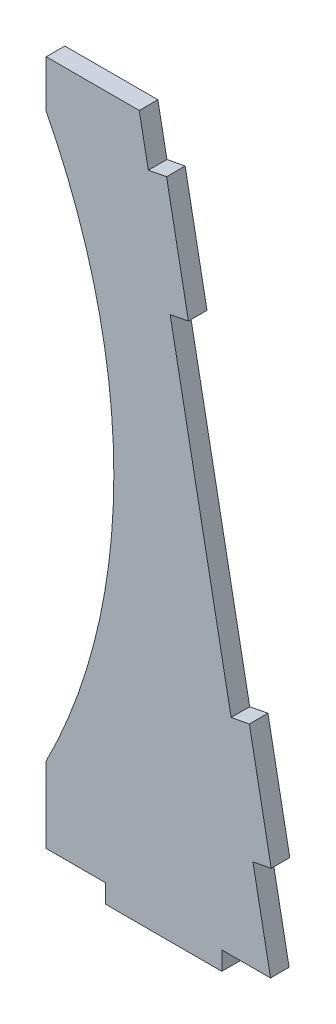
ISO-10303-21;
HEADER;
FILE_DESCRIPTION(('STEP AP214'),'2;1');
FILE_NAME('part.step','',(''),(''),'','','');
FILE_SCHEMA(('AUTOMOTIVE_DESIGN { 1 0 10303 214 1 1 1 1 }'));
ENDSEC;
DATA;
#1=APPLICATION_CONTEXT('core data for automotive mechanical design processes');
#2=APPLICATION_PROTOCOL_DEFINITION('international standard','automotive_design',2000,#1);
#3=PRODUCT_CONTEXT('',#1,'mechanical');
#4=PRODUCT('Part','Part','',(#3));
#5=PRODUCT_RELATED_PRODUCT_CATEGORY('part','',(#4));
#6=PRODUCT_DEFINITION_FORMATION('','',#4);
#7=PRODUCT_DEFINITION_CONTEXT('part definition',#1,'design');
#8=PRODUCT_DEFINITION('design','',#6,#7);
#9=PRODUCT_DEFINITION_SHAPE('','',#8);
#10=(LENGTH_UNIT() NAMED_UNIT(*) SI_UNIT(.MILLI.,.METRE.));
#11=(NAMED_UNIT(*) PLANE_ANGLE_UNIT() SI_UNIT($,.RADIAN.));
#12=(NAMED_UNIT(*) SI_UNIT($,.STERADIAN.) SOLID_ANGLE_UNIT());
#13=UNCERTAINTY_MEASURE_WITH_UNIT(LENGTH_MEASURE(1.E-05),#10,'distance_accuracy_value','');
#14=(GEOMETRIC_REPRESENTATION_CONTEXT(3) GLOBAL_UNCERTAINTY_ASSIGNED_CONTEXT((#13)) GLOBAL_UNIT_ASSIGNED_CONTEXT((#10,
#11,#12)) REPRESENTATION_CONTEXT('',''));
#15=CARTESIAN_POINT('',(0.,0.,0.));
#16=DIRECTION('',(0.,0.,1.));
#17=DIRECTION('',(1.,0.,0.));
#18=AXIS2_PLACEMENT_3D('',#15,#16,#17);
#19=CARTESIAN_POINT('',(28.5736769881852,1.143,1.524));
#20=DIRECTION('',(0.,1.,0.));
#21=DIRECTION('',(0.,0.,1.));
#22=AXIS2_PLACEMENT_3D('',#19,#20,#21);
#23=PLANE('',#22);
#24=DIRECTION('',(1.,0.,0.));
#25=VECTOR('',#24,1.);
#26=CARTESIAN_POINT('',(28.5736769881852,1.143,0.));
#27=LINE('',#26,#25);
#28=CARTESIAN_POINT('',(28.5736769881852,1.143,0.));
#29=VERTEX_POINT('',#28);
#30=CARTESIAN_POINT('',(33.443650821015,1.143,0.));
#31=VERTEX_POINT('',#30);
#32=EDGE_CURVE('E192',#29,#31,#27,.T.);
#33=ORIENTED_EDGE('',*,*,#32,.T.);
#34=DIRECTION('',(0.,0.,-1.));
#35=VECTOR('',#34,1.);
#36=CARTESIAN_POINT('',(33.443650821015,1.143,1.524));
#37=LINE('',#36,#35);
#38=CARTESIAN_POINT('',(33.443650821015,1.143,1.524));
#39=VERTEX_POINT('',#38);
#40=EDGE_CURVE('E11',#39,#31,#37,.T.);
#41=ORIENTED_EDGE('',*,*,#40,.F.);
#42=DIRECTION('',(1.,0.,0.));
#43=VECTOR('',#42,1.);
#44=CARTESIAN_POINT('',(28.5736769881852,1.143,1.524));
#45=LINE('',#44,#43);
#46=CARTESIAN_POINT('',(28.5736769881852,1.143,1.524));
#47=VERTEX_POINT('',#46);
#48=EDGE_CURVE('E226',#47,#39,#45,.T.);
#49=ORIENTED_EDGE('',*,*,#48,.F.);
#50=DIRECTION('',(0.,0.,-1.));
#51=VECTOR('',#50,1.);
#52=CARTESIAN_POINT('',(28.5736769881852,1.143,1.524));
#53=LINE('',#52,#51);
#54=EDGE_CURVE('E188',#47,#29,#53,.T.);
#55=ORIENTED_EDGE('',*,*,#54,.T.);
#56=EDGE_LOOP('',(#33,#41,#49,#55));
#57=FACE_BOUND('',#56,.T.);
#58=ADVANCED_FACE('F36',(#57),#23,.F.);
#59=CARTESIAN_POINT('',(33.443650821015,1.143,1.524));
#60=DIRECTION('',(1.,0.,0.));
#61=DIRECTION('',(0.,0.,-1.));
#62=AXIS2_PLACEMENT_3D('',#59,#60,#61);
#63=PLANE('',#62);
#64=DIRECTION('',(0.,-1.,0.));
#65=VECTOR('',#64,1.);
#66=CARTESIAN_POINT('',(33.443650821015,1.143,0.));
#67=LINE('',#66,#65);
#68=CARTESIAN_POINT('',(33.443650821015,-0.381,0.));
#69=VERTEX_POINT('',#68);
#70=EDGE_CURVE('E195',#31,#69,#67,.T.);
#71=ORIENTED_EDGE('',*,*,#70,.T.);
#72=DIRECTION('',(0.,0.,-1.));
#73=VECTOR('',#72,1.);
#74=CARTESIAN_POINT('',(33.443650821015,-0.381,1.524));
#75=LINE('',#74,#73);
#76=CARTESIAN_POINT('',(33.443650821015,-0.381,1.524));
#77=VERTEX_POINT('',#76);
#78=EDGE_CURVE('E44',#77,#69,#75,.T.);
#79=ORIENTED_EDGE('',*,*,#78,.F.);
#80=DIRECTION('',(0.,-1.,0.));
#81=VECTOR('',#80,1.);
#82=CARTESIAN_POINT('',(33.443650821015,1.143,1.524));
#83=LINE('',#82,#81);
#84=EDGE_CURVE('E125',#39,#77,#83,.T.);
#85=ORIENTED_EDGE('',*,*,#84,.F.);
#86=ORIENTED_EDGE('',*,*,#40,.T.);
#87=EDGE_LOOP('',(#71,#79,#85,#86));
#88=FACE_BOUND('',#87,.T.);
#89=ADVANCED_FACE('F334',(#88),#63,.F.);
#90=CARTESIAN_POINT('',(33.443650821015,-0.381,1.524));
#91=DIRECTION('',(0.,1.,0.));
#92=DIRECTION('',(0.,0.,1.));
#93=AXIS2_PLACEMENT_3D('',#90,#91,#92);
#94=PLANE('',#93);
#95=DIRECTION('',(1.,0.,0.));
#96=VECTOR('',#95,1.);
#97=CARTESIAN_POINT('',(33.443650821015,-0.381,0.));
#98=LINE('',#97,#96);
#99=CARTESIAN_POINT('',(42.968650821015,-0.381,0.));
#100=VERTEX_POINT('',#99);
#101=EDGE_CURVE('E197',#69,#100,#98,.T.);
#102=ORIENTED_EDGE('',*,*,#101,.T.);
#103=DIRECTION('',(0.,0.,-1.));
#104=VECTOR('',#103,1.);
#105=CARTESIAN_POINT('',(42.968650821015,-0.381,1.524));
#106=LINE('',#105,#104);
#107=CARTESIAN_POINT('',(42.968650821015,-0.381,1.524));
#108=VERTEX_POINT('',#107);
#109=EDGE_CURVE('E263',#108,#100,#106,.T.);
#110=ORIENTED_EDGE('',*,*,#109,.F.);
#111=DIRECTION('',(1.,0.,0.));
#112=VECTOR('',#111,1.);
#113=CARTESIAN_POINT('',(33.443650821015,-0.381,1.524));
#114=LINE('',#113,#112);
#115=EDGE_CURVE('E271',#77,#108,#114,.T.);
#116=ORIENTED_EDGE('',*,*,#115,.F.);
#117=ORIENTED_EDGE('',*,*,#78,.T.);
#118=EDGE_LOOP('',(#102,#110,#116,#117));
#119=FACE_BOUND('',#118,.T.);
#120=ADVANCED_FACE('F269',(#119),#94,.F.);
#121=CARTESIAN_POINT('',(42.968650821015,-0.381,1.524));
#122=DIRECTION('',(-1.,0.,0.));
#123=DIRECTION('',(0.,0.,1.));
#124=AXIS2_PLACEMENT_3D('',#121,#122,#123);
#125=PLANE('',#124);
#126=DIRECTION('',(0.,1.,0.));
#127=VECTOR('',#126,1.);
#128=CARTESIAN_POINT('',(42.968650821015,-0.381,0.));
#129=LINE('',#128,#127);
#130=CARTESIAN_POINT('',(42.968650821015,1.143,0.));
#131=VERTEX_POINT('',#130);
#132=EDGE_CURVE('E199',#100,#131,#129,.T.);
#133=ORIENTED_EDGE('',*,*,#132,.T.);
#134=DIRECTION('',(0.,0.,-1.));
#135=VECTOR('',#134,1.);
#136=CARTESIAN_POINT('',(42.968650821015,1.143,1.524));
#137=LINE('',#136,#135);
#138=CARTESIAN_POINT('',(42.968650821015,1.143,1.524));
#139=VERTEX_POINT('',#138);
#140=EDGE_CURVE('E260',#139,#131,#137,.T.);
#141=ORIENTED_EDGE('',*,*,#140,.F.);
#142=DIRECTION('',(0.,1.,0.));
#143=VECTOR('',#142,1.);
#144=CARTESIAN_POINT('',(42.968650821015,-0.381,1.524));
#145=LINE('',#144,#143);
#146=EDGE_CURVE('E289',#108,#139,#145,.T.);
#147=ORIENTED_EDGE('',*,*,#146,.F.);
#148=ORIENTED_EDGE('',*,*,#109,.T.);
#149=EDGE_LOOP('',(#133,#141,#147,#148));
#150=FACE_BOUND('',#149,.T.);
#151=ADVANCED_FACE('F280',(#150),#125,.F.);
#152=CARTESIAN_POINT('',(42.968650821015,1.143,1.524));
#153=DIRECTION('',(0.,1.,0.));
#154=DIRECTION('',(-1.,0.,0.));
#155=AXIS2_PLACEMENT_3D('',#152,#153,#154);
#156=PLANE('',#155);
#157=DIRECTION('',(1.,0.,0.));
#158=VECTOR('',#157,1.);
#159=CARTESIAN_POINT('',(42.968650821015,1.143,0.));
#160=LINE('',#159,#158);
#161=CARTESIAN_POINT('',(46.9624933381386,1.14300000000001,0.));
#162=VERTEX_POINT('',#161);
#163=EDGE_CURVE('E201',#131,#162,#160,.T.);
#164=ORIENTED_EDGE('',*,*,#163,.T.);
#165=DIRECTION('',(0.,0.,-1.));
#166=VECTOR('',#165,1.);
#167=CARTESIAN_POINT('',(46.9624933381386,1.14300000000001,1.524));
#168=LINE('',#167,#166);
#169=CARTESIAN_POINT('',(46.9624933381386,1.14300000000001,1.524));
#170=VERTEX_POINT('',#169);
#171=EDGE_CURVE('E257',#170,#162,#168,.T.);
#172=ORIENTED_EDGE('',*,*,#171,.F.);
#173=DIRECTION('',(1.,0.,0.));
#174=VECTOR('',#173,1.);
#175=CARTESIAN_POINT('',(42.968650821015,1.143,1.524));
#176=LINE('',#175,#174);
#177=EDGE_CURVE('E286',#139,#170,#176,.T.);
#178=ORIENTED_EDGE('',*,*,#177,.F.);
#179=ORIENTED_EDGE('',*,*,#140,.T.);
#180=EDGE_LOOP('',(#164,#172,#178,#179));
#181=FACE_BOUND('',#180,.T.);
#182=ADVANCED_FACE('F284',(#181),#156,.F.);
#183=CARTESIAN_POINT('',(46.9624933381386,1.14300000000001,1.524));
#184=DIRECTION('',(-0.982176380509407,-0.187961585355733,0.));
#185=DIRECTION('',(0.187961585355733,-0.982176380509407,0.));
#186=AXIS2_PLACEMENT_3D('',#183,#184,#185);
#187=PLANE('',#186);
#188=DIRECTION('',(-0.187961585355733,0.982176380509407,0.));
#189=VECTOR('',#188,1.);
#190=CARTESIAN_POINT('',(46.9624933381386,1.14300000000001,0.));
#191=LINE('',#190,#189);
#192=CARTESIAN_POINT('',(45.5219223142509,8.67057448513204,0.));
#193=VERTEX_POINT('',#192);
#194=EDGE_CURVE('E203',#162,#193,#191,.T.);
#195=ORIENTED_EDGE('',*,*,#194,.T.);
#196=DIRECTION('',(0.,0.,-1.));
#197=VECTOR('',#196,1.);
#198=CARTESIAN_POINT('',(45.5219223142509,8.67057448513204,1.524));
#199=LINE('',#198,#197);
#200=CARTESIAN_POINT('',(45.5219223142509,8.67057448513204,1.524));
#201=VERTEX_POINT('',#200);
#202=EDGE_CURVE('E254',#201,#193,#199,.T.);
#203=ORIENTED_EDGE('',*,*,#202,.F.);
#204=DIRECTION('',(-0.187961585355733,0.982176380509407,0.));
#205=VECTOR('',#204,1.);
#206=CARTESIAN_POINT('',(46.9624933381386,1.14300000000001,1.524));
#207=LINE('',#206,#205);
#208=EDGE_CURVE('E288',#170,#201,#207,.T.);
#209=ORIENTED_EDGE('',*,*,#208,.F.);
#210=ORIENTED_EDGE('',*,*,#171,.T.);
#211=EDGE_LOOP('',(#195,#203,#209,#210));
#212=FACE_BOUND('',#211,.T.);
#213=ADVANCED_FACE('F347',(#212),#187,.F.);
#214=CARTESIAN_POINT('',(45.5219223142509,8.67057448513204,1.524));
#215=DIRECTION('',(-0.187961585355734,0.982176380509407,0.));
#216=DIRECTION('',(-0.982176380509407,-0.187961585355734,0.));
#217=AXIS2_PLACEMENT_3D('',#214,#215,#216);
#218=PLANE('',#217);
#219=DIRECTION('',(0.982176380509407,0.187961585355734,0.));
#220=VECTOR('',#219,1.);
#221=CARTESIAN_POINT('',(45.5219223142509,8.67057448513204,0.));
#222=LINE('',#221,#220);
#223=CARTESIAN_POINT('',(47.0187591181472,8.95702794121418,0.));
#224=VERTEX_POINT('',#223);
#225=EDGE_CURVE('E205',#193,#224,#222,.T.);
#226=ORIENTED_EDGE('',*,*,#225,.T.);
#227=DIRECTION('',(0.,0.,-1.));
#228=VECTOR('',#227,1.);
#229=CARTESIAN_POINT('',(47.0187591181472,8.95702794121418,1.524));
#230=LINE('',#229,#228);
#231=CARTESIAN_POINT('',(47.0187591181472,8.95702794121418,1.524));
#232=VERTEX_POINT('',#231);
#233=EDGE_CURVE('E251',#232,#224,#230,.T.);
#234=ORIENTED_EDGE('',*,*,#233,.F.);
#235=DIRECTION('',(0.982176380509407,0.187961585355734,0.));
#236=VECTOR('',#235,1.);
#237=CARTESIAN_POINT('',(45.5219223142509,8.67057448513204,1.524));
#238=LINE('',#237,#236);
#239=EDGE_CURVE('E291',#201,#232,#238,.T.);
#240=ORIENTED_EDGE('',*,*,#239,.F.);
#241=ORIENTED_EDGE('',*,*,#202,.T.);
#242=EDGE_LOOP('',(#226,#234,#240,#241));
#243=FACE_BOUND('',#242,.T.);
#244=ADVANCED_FACE('F350',(#243),#218,.F.);
#245=CARTESIAN_POINT('',(47.0187591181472,8.95702794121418,1.524));
#246=DIRECTION('',(-0.982176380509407,-0.187961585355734,0.));
#247=DIRECTION('',(0.187961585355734,-0.982176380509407,0.));
#248=AXIS2_PLACEMENT_3D('',#245,#246,#247);
#249=PLANE('',#248);
#250=DIRECTION('',(-0.187961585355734,0.982176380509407,0.));
#251=VECTOR('',#250,1.);
#252=CARTESIAN_POINT('',(47.0187591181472,8.95702794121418,0.));
#253=LINE('',#252,#251);
#254=CARTESIAN_POINT('',(45.2284250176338,18.3122579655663,0.));
#255=VERTEX_POINT('',#254);
#256=EDGE_CURVE('E207',#224,#255,#253,.T.);
#257=ORIENTED_EDGE('',*,*,#256,.T.);
#258=DIRECTION('',(0.,0.,-1.));
#259=VECTOR('',#258,1.);
#260=CARTESIAN_POINT('',(45.2284250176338,18.3122579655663,1.524));
#261=LINE('',#260,#259);
#262=CARTESIAN_POINT('',(45.2284250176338,18.3122579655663,1.524));
#263=VERTEX_POINT('',#262);
#264=EDGE_CURVE('E248',#263,#255,#261,.T.);
#265=ORIENTED_EDGE('',*,*,#264,.F.);
#266=DIRECTION('',(-0.187961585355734,0.982176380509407,0.));
#267=VECTOR('',#266,1.);
#268=CARTESIAN_POINT('',(47.0187591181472,8.95702794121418,1.524));
#269=LINE('',#268,#267);
#270=EDGE_CURVE('E297',#232,#263,#269,.T.);
#271=ORIENTED_EDGE('',*,*,#270,.F.);
#272=ORIENTED_EDGE('',*,*,#233,.T.);
#273=EDGE_LOOP('',(#257,#265,#271,#272));
#274=FACE_BOUND('',#273,.T.);
#275=ADVANCED_FACE('F354',(#274),#249,.F.);
#276=CARTESIAN_POINT('',(43.7315882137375,18.0258045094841,1.524));
#277=DIRECTION('',(0.187961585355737,-0.982176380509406,0.));
#278=DIRECTION('',(0.982176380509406,0.187961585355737,0.));
#279=AXIS2_PLACEMENT_3D('',#276,#277,#278);
#280=PLANE('',#279);
#281=DIRECTION('',(-0.982176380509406,-0.187961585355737,0.));
#282=VECTOR('',#281,1.);
#283=CARTESIAN_POINT('',(43.7315882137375,18.0258045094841,0.));
#284=LINE('',#283,#282);
#285=CARTESIAN_POINT('',(43.7315882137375,18.0258045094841,0.));
#286=VERTEX_POINT('',#285);
#287=EDGE_CURVE('E209',#255,#286,#284,.T.);
#288=ORIENTED_EDGE('',*,*,#287,.T.);
#289=DIRECTION('',(0.,0.,-1.));
#290=VECTOR('',#289,1.);
#291=CARTESIAN_POINT('',(43.7315882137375,18.0258045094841,1.524));
#292=LINE('',#291,#290);
#293=CARTESIAN_POINT('',(43.7315882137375,18.0258045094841,1.524));
#294=VERTEX_POINT('',#293);
#295=EDGE_CURVE('E245',#294,#286,#292,.T.);
#296=ORIENTED_EDGE('',*,*,#295,.F.);
#297=DIRECTION('',(-0.982176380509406,-0.187961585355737,0.));
#298=VECTOR('',#297,1.);
#299=CARTESIAN_POINT('',(43.7315882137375,18.0258045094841,1.524));
#300=LINE('',#299,#298);
#301=EDGE_CURVE('E299',#263,#294,#300,.T.);
#302=ORIENTED_EDGE('',*,*,#301,.F.);
#303=ORIENTED_EDGE('',*,*,#264,.T.);
#304=EDGE_LOOP('',(#288,#296,#302,#303));
#305=FACE_BOUND('',#304,.T.);
#306=ADVANCED_FACE('F358',(#305),#280,.F.);
#307=CARTESIAN_POINT('',(43.7315882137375,18.0258045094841,1.524));
#308=DIRECTION('',(-0.982176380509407,-0.187961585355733,0.));
#309=DIRECTION('',(0.187961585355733,-0.982176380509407,0.));
#310=AXIS2_PLACEMENT_3D('',#307,#308,#309);
#311=PLANE('',#310);
#312=DIRECTION('',(-0.187961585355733,0.982176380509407,0.));
#313=VECTOR('',#312,1.);
#314=CARTESIAN_POINT('',(43.7315882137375,18.0258045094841,0.));
#315=LINE('',#314,#313);
#316=CARTESIAN_POINT('',(38.7351799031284,44.1340873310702,0.));
#317=VERTEX_POINT('',#316);
#318=EDGE_CURVE('E211',#286,#317,#315,.T.);
#319=ORIENTED_EDGE('',*,*,#318,.T.);
#320=DIRECTION('',(0.,0.,-1.));
#321=VECTOR('',#320,1.);
#322=CARTESIAN_POINT('',(38.7351799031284,44.1340873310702,1.524));
#323=LINE('',#322,#321);
#324=CARTESIAN_POINT('',(38.7351799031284,44.1340873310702,1.524));
#325=VERTEX_POINT('',#324);
#326=EDGE_CURVE('E242',#325,#317,#323,.T.);
#327=ORIENTED_EDGE('',*,*,#326,.F.);
#328=DIRECTION('',(-0.187961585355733,0.982176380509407,0.));
#329=VECTOR('',#328,1.);
#330=CARTESIAN_POINT('',(43.7315882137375,18.0258045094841,1.524));
#331=LINE('',#330,#329);
#332=EDGE_CURVE('E301',#294,#325,#331,.T.);
#333=ORIENTED_EDGE('',*,*,#332,.F.);
#334=ORIENTED_EDGE('',*,*,#295,.T.);
#335=EDGE_LOOP('',(#319,#327,#333,#334));
#336=FACE_BOUND('',#335,.T.);
#337=ADVANCED_FACE('F362',(#336),#311,.F.);
#338=CARTESIAN_POINT('',(38.7351799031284,44.1340873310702,1.524));
#339=DIRECTION('',(-0.187961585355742,0.982176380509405,0.));
#340=DIRECTION('',(-0.982176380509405,-0.187961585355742,0.));
#341=AXIS2_PLACEMENT_3D('',#338,#339,#340);
#342=PLANE('',#341);
#343=DIRECTION('',(0.982176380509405,0.187961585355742,0.));
#344=VECTOR('',#343,1.);
#345=CARTESIAN_POINT('',(38.7351799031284,44.1340873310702,0.));
#346=LINE('',#345,#344);
#347=CARTESIAN_POINT('',(40.2320167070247,44.4205407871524,0.));
#348=VERTEX_POINT('',#347);
#349=EDGE_CURVE('E213',#317,#348,#346,.T.);
#350=ORIENTED_EDGE('',*,*,#349,.T.);
#351=DIRECTION('',(0.,0.,-1.));
#352=VECTOR('',#351,1.);
#353=CARTESIAN_POINT('',(40.2320167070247,44.4205407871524,1.524));
#354=LINE('',#353,#352);
#355=CARTESIAN_POINT('',(40.2320167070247,44.4205407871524,1.524));
#356=VERTEX_POINT('',#355);
#357=EDGE_CURVE('E239',#356,#348,#354,.T.);
#358=ORIENTED_EDGE('',*,*,#357,.F.);
#359=DIRECTION('',(0.982176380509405,0.187961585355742,0.));
#360=VECTOR('',#359,1.);
#361=CARTESIAN_POINT('',(38.7351799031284,44.1340873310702,1.524));
#362=LINE('',#361,#360);
#363=EDGE_CURVE('E303',#325,#356,#362,.T.);
#364=ORIENTED_EDGE('',*,*,#363,.F.);
#365=ORIENTED_EDGE('',*,*,#326,.T.);
#366=EDGE_LOOP('',(#350,#358,#364,#365));
#367=FACE_BOUND('',#366,.T.);
#368=ADVANCED_FACE('F366',(#367),#342,.F.);
#369=CARTESIAN_POINT('',(40.2320167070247,44.4205407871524,1.524));
#370=DIRECTION('',(-0.982176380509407,-0.187961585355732,0.));
#371=DIRECTION('',(0.187961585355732,-0.982176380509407,0.));
#372=AXIS2_PLACEMENT_3D('',#369,#370,#371);
#373=PLANE('',#372);
#374=DIRECTION('',(-0.187961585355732,0.982176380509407,0.));
#375=VECTOR('',#374,1.);
#376=CARTESIAN_POINT('',(40.2320167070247,44.4205407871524,0.));
#377=LINE('',#376,#375);
#378=CARTESIAN_POINT('',(38.4416826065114,53.7757708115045,0.));
#379=VERTEX_POINT('',#378);
#380=EDGE_CURVE('E215',#348,#379,#377,.T.);
#381=ORIENTED_EDGE('',*,*,#380,.T.);
#382=DIRECTION('',(0.,0.,-1.));
#383=VECTOR('',#382,1.);
#384=CARTESIAN_POINT('',(38.4416826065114,53.7757708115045,1.524));
#385=LINE('',#384,#383);
#386=CARTESIAN_POINT('',(38.4416826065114,53.7757708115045,1.524));
#387=VERTEX_POINT('',#386);
#388=EDGE_CURVE('E236',#387,#379,#385,.T.);
#389=ORIENTED_EDGE('',*,*,#388,.F.);
#390=DIRECTION('',(-0.187961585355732,0.982176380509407,0.));
#391=VECTOR('',#390,1.);
#392=CARTESIAN_POINT('',(40.2320167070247,44.4205407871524,1.524));
#393=LINE('',#392,#391);
#394=EDGE_CURVE('E305',#356,#387,#393,.T.);
#395=ORIENTED_EDGE('',*,*,#394,.F.);
#396=ORIENTED_EDGE('',*,*,#357,.T.);
#397=EDGE_LOOP('',(#381,#389,#395,#396));
#398=FACE_BOUND('',#397,.T.);
#399=ADVANCED_FACE('F370',(#398),#373,.F.);
#400=CARTESIAN_POINT('',(36.9448458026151,53.4893173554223,1.524));
#401=DIRECTION('',(0.187961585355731,-0.982176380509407,0.));
#402=DIRECTION('',(0.982176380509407,0.187961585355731,0.));
#403=AXIS2_PLACEMENT_3D('',#400,#401,#402);
#404=PLANE('',#403);
#405=DIRECTION('',(-0.982176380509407,-0.187961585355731,0.));
#406=VECTOR('',#405,1.);
#407=CARTESIAN_POINT('',(36.9448458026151,53.4893173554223,0.));
#408=LINE('',#407,#406);
#409=CARTESIAN_POINT('',(36.9448458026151,53.4893173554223,0.));
#410=VERTEX_POINT('',#409);
#411=EDGE_CURVE('E217',#379,#410,#408,.T.);
#412=ORIENTED_EDGE('',*,*,#411,.T.);
#413=DIRECTION('',(0.,0.,-1.));
#414=VECTOR('',#413,1.);
#415=CARTESIAN_POINT('',(36.9448458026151,53.4893173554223,1.524));
#416=LINE('',#415,#414);
#417=CARTESIAN_POINT('',(36.9448458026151,53.4893173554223,1.524));
#418=VERTEX_POINT('',#417);
#419=EDGE_CURVE('E233',#418,#410,#416,.T.);
#420=ORIENTED_EDGE('',*,*,#419,.F.);
#421=DIRECTION('',(-0.982176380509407,-0.187961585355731,0.));
#422=VECTOR('',#421,1.);
#423=CARTESIAN_POINT('',(36.9448458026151,53.4893173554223,1.524));
#424=LINE('',#423,#422);
#425=EDGE_CURVE('E307',#387,#418,#424,.T.);
#426=ORIENTED_EDGE('',*,*,#425,.F.);
#427=ORIENTED_EDGE('',*,*,#388,.T.);
#428=EDGE_LOOP('',(#412,#420,#426,#427));
#429=FACE_BOUND('',#428,.T.);
#430=ADVANCED_FACE('F374',(#429),#404,.F.);
#431=CARTESIAN_POINT('',(36.9448458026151,53.4893173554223,1.524));
#432=DIRECTION('',(-0.982176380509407,-0.187961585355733,0.));
#433=DIRECTION('',(0.187961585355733,-0.982176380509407,0.));
#434=AXIS2_PLACEMENT_3D('',#431,#432,#433);
#435=PLANE('',#434);
#436=DIRECTION('',(-0.187961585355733,0.982176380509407,0.));
#437=VECTOR('',#436,1.);
#438=CARTESIAN_POINT('',(36.9448458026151,53.4893173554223,0.));
#439=LINE('',#438,#437);
#440=CARTESIAN_POINT('',(36.2039034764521,57.3610449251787,0.));
#441=VERTEX_POINT('',#440);
#442=EDGE_CURVE('E219',#410,#441,#439,.T.);
#443=ORIENTED_EDGE('',*,*,#442,.T.);
#444=DIRECTION('',(0.,0.,-1.));
#445=VECTOR('',#444,1.);
#446=CARTESIAN_POINT('',(36.2039034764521,57.3610449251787,1.524));
#447=LINE('',#446,#445);
#448=CARTESIAN_POINT('',(36.2039034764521,57.3610449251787,1.524));
#449=VERTEX_POINT('',#448);
#450=EDGE_CURVE('E230',#449,#441,#447,.T.);
#451=ORIENTED_EDGE('',*,*,#450,.F.);
#452=DIRECTION('',(-0.187961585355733,0.982176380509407,0.));
#453=VECTOR('',#452,1.);
#454=CARTESIAN_POINT('',(36.9448458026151,53.4893173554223,1.524));
#455=LINE('',#454,#453);
#456=EDGE_CURVE('E309',#418,#449,#455,.T.);
#457=ORIENTED_EDGE('',*,*,#456,.F.);
#458=ORIENTED_EDGE('',*,*,#419,.T.);
#459=EDGE_LOOP('',(#443,#451,#457,#458));
#460=FACE_BOUND('',#459,.T.);
#461=ADVANCED_FACE('F315',(#460),#435,.F.);
#462=CARTESIAN_POINT('',(36.2039034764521,57.3610449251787,1.524));
#463=DIRECTION('',(0.,-1.,0.));
#464=DIRECTION('',(0.,0.,-1.));
#465=AXIS2_PLACEMENT_3D('',#462,#463,#464);
#466=PLANE('',#465);
#467=DIRECTION('',(-1.,0.,0.));
#468=VECTOR('',#467,1.);
#469=CARTESIAN_POINT('',(36.2039034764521,57.3610449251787,0.));
#470=LINE('',#469,#468);
#471=CARTESIAN_POINT('',(28.5736769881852,57.3610449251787,0.));
#472=VERTEX_POINT('',#471);
#473=EDGE_CURVE('E221',#441,#472,#470,.T.);
#474=ORIENTED_EDGE('',*,*,#473,.T.);
#475=DIRECTION('',(0.,0.,-1.));
#476=VECTOR('',#475,1.);
#477=CARTESIAN_POINT('',(28.5736769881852,57.3610449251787,1.524));
#478=LINE('',#477,#476);
#479=CARTESIAN_POINT('',(28.5736769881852,57.3610449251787,1.524));
#480=VERTEX_POINT('',#479);
#481=EDGE_CURVE('E183',#480,#472,#478,.T.);
#482=ORIENTED_EDGE('',*,*,#481,.F.);
#483=DIRECTION('',(-1.,0.,0.));
#484=VECTOR('',#483,1.);
#485=CARTESIAN_POINT('',(36.2039034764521,57.3610449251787,1.524));
#486=LINE('',#485,#484);
#487=EDGE_CURVE('E174',#449,#480,#486,.T.);
#488=ORIENTED_EDGE('',*,*,#487,.F.);
#489=ORIENTED_EDGE('',*,*,#450,.T.);
#490=EDGE_LOOP('',(#474,#482,#488,#489));
#491=FACE_BOUND('',#490,.T.);
#492=ADVANCED_FACE('F319',(#491),#466,.F.);
#493=CARTESIAN_POINT('',(28.5736769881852,57.3610449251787,1.524));
#494=DIRECTION('',(1.,0.,0.));
#495=DIRECTION('',(0.,0.,-1.));
#496=AXIS2_PLACEMENT_3D('',#493,#494,#495);
#497=PLANE('',#496);
#498=DIRECTION('',(0.,-1.,0.));
#499=VECTOR('',#498,1.);
#500=CARTESIAN_POINT('',(28.5736769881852,57.3610449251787,0.));
#501=LINE('',#500,#499);
#502=CARTESIAN_POINT('',(28.5736769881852,53.4893173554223,0.));
#503=VERTEX_POINT('',#502);
#504=EDGE_CURVE('E182',#472,#503,#501,.T.);
#505=ORIENTED_EDGE('',*,*,#504,.T.);
#506=DIRECTION('',(0.,0.,-1.));
#507=VECTOR('',#506,1.);
#508=CARTESIAN_POINT('',(28.5736769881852,53.4893173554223,1.524));
#509=LINE('',#508,#507);
#510=CARTESIAN_POINT('',(28.5736769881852,53.4893173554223,1.524));
#511=VERTEX_POINT('',#510);
#512=EDGE_CURVE('E179',#511,#503,#509,.T.);
#513=ORIENTED_EDGE('',*,*,#512,.F.);
#514=DIRECTION('',(0.,-1.,0.));
#515=VECTOR('',#514,1.);
#516=CARTESIAN_POINT('',(28.5736769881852,57.3610449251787,1.524));
#517=LINE('',#516,#515);
#518=EDGE_CURVE('E168',#480,#511,#517,.T.);
#519=ORIENTED_EDGE('',*,*,#518,.F.);
#520=ORIENTED_EDGE('',*,*,#481,.T.);
#521=EDGE_LOOP('',(#505,#513,#519,#520));
#522=FACE_BOUND('',#521,.T.);
#523=ADVANCED_FACE('F180',(#522),#497,.F.);
#524=CARTESIAN_POINT('',(-16.6138765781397,30.4265033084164,1.524));
#525=DIRECTION('',(0.,0.,-1.));
#526=DIRECTION('',(-1.,0.,0.));
#527=AXIS2_PLACEMENT_3D('',#524,#525,#526);
#528=CYLINDRICAL_SURFACE('',#527,50.7327151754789);
#529=CARTESIAN_POINT('',(-16.6138765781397,30.4265033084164,0.));
#530=DIRECTION('',(0.,0.,-1.));
#531=DIRECTION('',(1.,0.,0.));
#532=AXIS2_PLACEMENT_3D('',#529,#530,#531);
#533=CIRCLE('',#532,50.7327151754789);
#534=CARTESIAN_POINT('',(28.5736769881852,7.36368926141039,0.));
#535=VERTEX_POINT('',#534);
#536=EDGE_CURVE('E111',#503,#535,#533,.T.);
#537=ORIENTED_EDGE('',*,*,#536,.T.);
#538=DIRECTION('',(0.,0.,-1.));
#539=VECTOR('',#538,1.);
#540=CARTESIAN_POINT('',(28.5736769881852,7.36368926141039,1.524));
#541=LINE('',#540,#539);
#542=CARTESIAN_POINT('',(28.5736769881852,7.36368926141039,1.524));
#543=VERTEX_POINT('',#542);
#544=EDGE_CURVE('E184',#543,#535,#541,.T.);
#545=ORIENTED_EDGE('',*,*,#544,.F.);
#546=CARTESIAN_POINT('',(-16.6138765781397,30.4265033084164,1.524));
#547=DIRECTION('',(0.,0.,-1.));
#548=DIRECTION('',(1.,0.,0.));
#549=AXIS2_PLACEMENT_3D('',#546,#547,#548);
#550=CIRCLE('',#549,50.7327151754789);
#551=EDGE_CURVE('E172',#511,#543,#550,.T.);
#552=ORIENTED_EDGE('',*,*,#551,.F.);
#553=ORIENTED_EDGE('',*,*,#512,.T.);
#554=EDGE_LOOP('',(#537,#545,#552,#553));
#555=FACE_BOUND('',#554,.T.);
#556=ADVANCED_FACE('F186',(#555),#528,.F.);
#557=CARTESIAN_POINT('',(28.5736769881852,7.3636892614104,1.524));
#558=DIRECTION('',(1.,0.,0.));
#559=DIRECTION('',(0.,0.,-1.));
#560=AXIS2_PLACEMENT_3D('',#557,#558,#559);
#561=PLANE('',#560);
#562=DIRECTION('',(0.,-1.,0.));
#563=VECTOR('',#562,1.);
#564=CARTESIAN_POINT('',(28.5736769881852,7.3636892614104,0.));
#565=LINE('',#564,#563);
#566=EDGE_CURVE('E117',#535,#29,#565,.T.);
#567=ORIENTED_EDGE('',*,*,#566,.T.);
#568=ORIENTED_EDGE('',*,*,#54,.F.);
#569=DIRECTION('',(0.,-1.,0.));
#570=VECTOR('',#569,1.);
#571=CARTESIAN_POINT('',(28.5736769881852,7.3636892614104,1.524));
#572=LINE('',#571,#570);
#573=EDGE_CURVE('E52',#543,#47,#572,.T.);
#574=ORIENTED_EDGE('',*,*,#573,.F.);
#575=ORIENTED_EDGE('',*,*,#544,.T.);
#576=EDGE_LOOP('',(#567,#568,#574,#575));
#577=FACE_BOUND('',#576,.T.);
#578=ADVANCED_FACE('F323',(#577),#561,.F.);
#579=CARTESIAN_POINT('',(-16.6138765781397,30.4265033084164,1.524));
#580=DIRECTION('',(0.,0.,1.));
#581=DIRECTION('',(1.,0.,0.));
#582=AXIS2_PLACEMENT_3D('',#579,#580,#581);
#583=PLANE('',#582);
#584=ORIENTED_EDGE('',*,*,#48,.T.);
#585=ORIENTED_EDGE('',*,*,#84,.T.);
#586=ORIENTED_EDGE('',*,*,#115,.T.);
#587=ORIENTED_EDGE('',*,*,#146,.T.);
#588=ORIENTED_EDGE('',*,*,#177,.T.);
#589=ORIENTED_EDGE('',*,*,#208,.T.);
#590=ORIENTED_EDGE('',*,*,#239,.T.);
#591=ORIENTED_EDGE('',*,*,#270,.T.);
#592=ORIENTED_EDGE('',*,*,#301,.T.);
#593=ORIENTED_EDGE('',*,*,#332,.T.);
#594=ORIENTED_EDGE('',*,*,#363,.T.);
#595=ORIENTED_EDGE('',*,*,#394,.T.);
#596=ORIENTED_EDGE('',*,*,#425,.T.);
#597=ORIENTED_EDGE('',*,*,#456,.T.);
#598=ORIENTED_EDGE('',*,*,#487,.T.);
#599=ORIENTED_EDGE('',*,*,#518,.T.);
#600=ORIENTED_EDGE('',*,*,#551,.T.);
#601=ORIENTED_EDGE('',*,*,#573,.T.);
#602=EDGE_LOOP('',(#584,#585,#586,#587,#588,#589,#590,#591,#592,#593,#594,#595,#596,#597,#598,
#599,#600,#601));
#603=FACE_BOUND('',#602,.T.);
#604=ADVANCED_FACE('F170',(#603),#583,.T.);
#605=CARTESIAN_POINT('',(-16.6138765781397,30.4265033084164,0.));
#606=DIRECTION('',(0.,0.,1.));
#607=DIRECTION('',(1.,0.,0.));
#608=AXIS2_PLACEMENT_3D('',#605,#606,#607);
#609=PLANE('',#608);
#610=ORIENTED_EDGE('',*,*,#32,.F.);
#611=ORIENTED_EDGE('',*,*,#566,.F.);
#612=ORIENTED_EDGE('',*,*,#536,.F.);
#613=ORIENTED_EDGE('',*,*,#504,.F.);
#614=ORIENTED_EDGE('',*,*,#473,.F.);
#615=ORIENTED_EDGE('',*,*,#442,.F.);
#616=ORIENTED_EDGE('',*,*,#411,.F.);
#617=ORIENTED_EDGE('',*,*,#380,.F.);
#618=ORIENTED_EDGE('',*,*,#349,.F.);
#619=ORIENTED_EDGE('',*,*,#318,.F.);
#620=ORIENTED_EDGE('',*,*,#287,.F.);
#621=ORIENTED_EDGE('',*,*,#256,.F.);
#622=ORIENTED_EDGE('',*,*,#225,.F.);
#623=ORIENTED_EDGE('',*,*,#194,.F.);
#624=ORIENTED_EDGE('',*,*,#163,.F.);
#625=ORIENTED_EDGE('',*,*,#132,.F.);
#626=ORIENTED_EDGE('',*,*,#101,.F.);
#627=ORIENTED_EDGE('',*,*,#70,.F.);
#628=EDGE_LOOP('',(#610,#611,#612,#613,#614,#615,#616,#617,#618,#619,#620,#621,#622,#623,#624,
#625,#626,#627));
#629=FACE_BOUND('',#628,.T.);
#630=ADVANCED_FACE('F275',(#629),#609,.F.);
#631=CLOSED_SHELL('',(#58,#89,#120,#151,#182,#213,#244,#275,#306,#337,#368,#399,#430,#461,#492,
#523,#556,#578,#604,#630));
#632=MANIFOLD_SOLID_BREP('B2',#631);
#633=ADVANCED_BREP_SHAPE_REPRESENTATION('',(#18,#632),#14);
#634=SHAPE_DEFINITION_REPRESENTATION(#9,#633);
ENDSEC;
END-ISO-10303-21;
